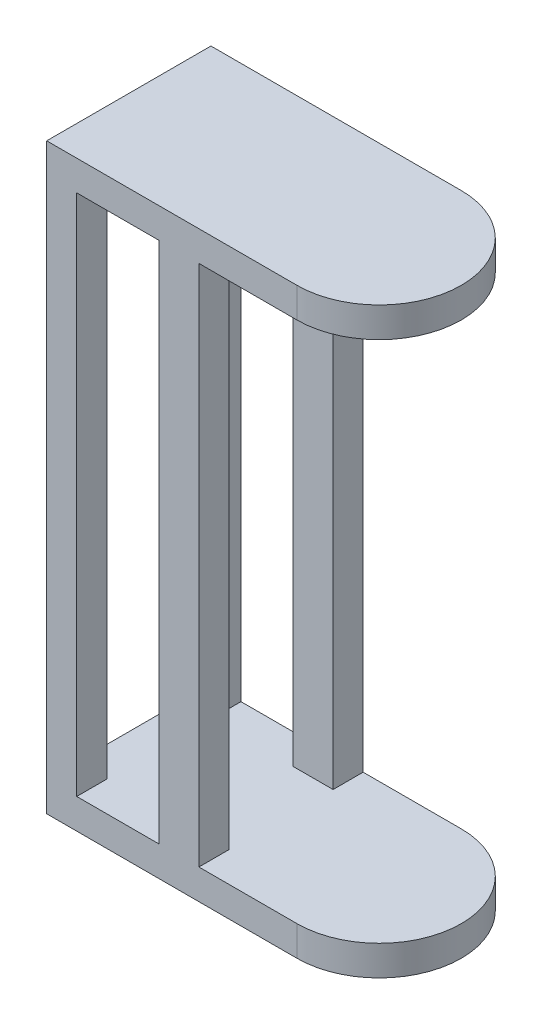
ISO-10303-21;
HEADER;
FILE_DESCRIPTION(('STEP AP214'),'2;1');
FILE_NAME('part.step','',(''),(''),'','','');
FILE_SCHEMA(('AUTOMOTIVE_DESIGN { 1 0 10303 214 1 1 1 1 }'));
ENDSEC;
DATA;
#1=APPLICATION_CONTEXT('core data for automotive mechanical design processes');
#2=APPLICATION_PROTOCOL_DEFINITION('international standard','automotive_design',2000,#1);
#3=PRODUCT_CONTEXT('',#1,'mechanical');
#4=PRODUCT('Part','Part','',(#3));
#5=PRODUCT_RELATED_PRODUCT_CATEGORY('part','',(#4));
#6=PRODUCT_DEFINITION_FORMATION('','',#4);
#7=PRODUCT_DEFINITION_CONTEXT('part definition',#1,'design');
#8=PRODUCT_DEFINITION('design','',#6,#7);
#9=PRODUCT_DEFINITION_SHAPE('','',#8);
#10=(LENGTH_UNIT() NAMED_UNIT(*) SI_UNIT(.MILLI.,.METRE.));
#11=(NAMED_UNIT(*) PLANE_ANGLE_UNIT() SI_UNIT($,.RADIAN.));
#12=(NAMED_UNIT(*) SI_UNIT($,.STERADIAN.) SOLID_ANGLE_UNIT());
#13=UNCERTAINTY_MEASURE_WITH_UNIT(LENGTH_MEASURE(1.E-05),#10,'distance_accuracy_value','');
#14=(GEOMETRIC_REPRESENTATION_CONTEXT(3) GLOBAL_UNCERTAINTY_ASSIGNED_CONTEXT((#13)) GLOBAL_UNIT_ASSIGNED_CONTEXT((#10,
#11,#12)) REPRESENTATION_CONTEXT('',''));
#15=CARTESIAN_POINT('',(0.,0.,0.));
#16=DIRECTION('',(0.,0.,1.));
#17=DIRECTION('',(1.,0.,0.));
#18=AXIS2_PLACEMENT_3D('',#15,#16,#17);
#19=CARTESIAN_POINT('',(126.,130.5,-26.));
#20=DIRECTION('',(0.,0.,-1.));
#21=DIRECTION('',(-1.,0.,0.));
#22=AXIS2_PLACEMENT_3D('',#19,#20,#21);
#23=PLANE('',#22);
#24=DIRECTION('',(-1.,0.,0.));
#25=VECTOR('',#24,1.);
#26=CARTESIAN_POINT('',(126.,-130.5,-26.));
#27=LINE('',#26,#25);
#28=CARTESIAN_POINT('',(-25.,-130.5,-26.));
#29=VERTEX_POINT('',#28);
#30=CARTESIAN_POINT('',(-40.,-130.5,-26.));
#31=VERTEX_POINT('',#30);
#32=EDGE_CURVE('E230',#29,#31,#27,.T.);
#33=ORIENTED_EDGE('',*,*,#32,.F.);
#34=DIRECTION('',(0.,1.,0.));
#35=VECTOR('',#34,1.);
#36=CARTESIAN_POINT('',(-25.,130.5,-26.));
#37=LINE('',#36,#35);
#38=CARTESIAN_POINT('',(-25.,130.5,-26.));
#39=VERTEX_POINT('',#38);
#40=EDGE_CURVE('E215',#29,#39,#37,.T.);
#41=ORIENTED_EDGE('',*,*,#40,.T.);
#42=DIRECTION('',(-1.,0.,0.));
#43=VECTOR('',#42,1.);
#44=CARTESIAN_POINT('',(126.,130.5,-26.));
#45=LINE('',#44,#43);
#46=CARTESIAN_POINT('',(-40.,130.5,-26.));
#47=VERTEX_POINT('',#46);
#48=EDGE_CURVE('E235',#39,#47,#45,.T.);
#49=ORIENTED_EDGE('',*,*,#48,.T.);
#50=DIRECTION('',(0.,-1.,0.));
#51=VECTOR('',#50,1.);
#52=CARTESIAN_POINT('',(-40.,130.5,-26.));
#53=LINE('',#52,#51);
#54=EDGE_CURVE('E218',#47,#31,#53,.T.);
#55=ORIENTED_EDGE('',*,*,#54,.T.);
#56=EDGE_LOOP('',(#33,#41,#49,#55));
#57=FACE_BOUND('',#56,.T.);
#58=ADVANCED_FACE('F29',(#57),#23,.F.);
#59=CARTESIAN_POINT('',(126.,-130.5,26.));
#60=DIRECTION('',(0.,0.,1.));
#61=DIRECTION('',(1.,0.,0.));
#62=AXIS2_PLACEMENT_3D('',#59,#60,#61);
#63=PLANE('',#62);
#64=DIRECTION('',(-1.,0.,0.));
#65=VECTOR('',#64,1.);
#66=CARTESIAN_POINT('',(126.,130.5,26.));
#67=LINE('',#66,#65);
#68=CARTESIAN_POINT('',(-25.,130.5,26.));
#69=VERTEX_POINT('',#68);
#70=CARTESIAN_POINT('',(-40.,130.5,26.));
#71=VERTEX_POINT('',#70);
#72=EDGE_CURVE('E239',#69,#71,#67,.T.);
#73=ORIENTED_EDGE('',*,*,#72,.F.);
#74=DIRECTION('',(0.,-1.,0.));
#75=VECTOR('',#74,1.);
#76=CARTESIAN_POINT('',(-25.,-130.5,26.));
#77=LINE('',#76,#75);
#78=CARTESIAN_POINT('',(-25.,-130.5,26.));
#79=VERTEX_POINT('',#78);
#80=EDGE_CURVE('E11',#69,#79,#77,.T.);
#81=ORIENTED_EDGE('',*,*,#80,.T.);
#82=DIRECTION('',(-1.,0.,0.));
#83=VECTOR('',#82,1.);
#84=CARTESIAN_POINT('',(126.,-130.5,26.));
#85=LINE('',#84,#83);
#86=CARTESIAN_POINT('',(-40.,-130.5,26.));
#87=VERTEX_POINT('',#86);
#88=EDGE_CURVE('E242',#79,#87,#85,.T.);
#89=ORIENTED_EDGE('',*,*,#88,.T.);
#90=DIRECTION('',(0.,1.,0.));
#91=VECTOR('',#90,1.);
#92=CARTESIAN_POINT('',(-40.,-130.5,26.));
#93=LINE('',#92,#91);
#94=EDGE_CURVE('E224',#87,#71,#93,.T.);
#95=ORIENTED_EDGE('',*,*,#94,.T.);
#96=EDGE_LOOP('',(#73,#81,#89,#95));
#97=FACE_BOUND('',#96,.T.);
#98=ADVANCED_FACE('F361',(#97),#63,.F.);
#99=CARTESIAN_POINT('',(36.0000000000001,130.5,-41.));
#100=DIRECTION('',(-1.,0.,0.));
#101=DIRECTION('',(0.,0.,1.));
#102=AXIS2_PLACEMENT_3D('',#99,#100,#101);
#103=PLANE('',#102);
#104=DIRECTION('',(0.,0.,1.));
#105=VECTOR('',#104,1.);
#106=CARTESIAN_POINT('',(36.0000000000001,130.5,-41.));
#107=LINE('',#106,#105);
#108=CARTESIAN_POINT('',(36.0000000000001,130.5,-41.));
#109=VERTEX_POINT('',#108);
#110=CARTESIAN_POINT('',(36.0000000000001,130.5,-26.));
#111=VERTEX_POINT('',#110);
#112=EDGE_CURVE('E265',#109,#111,#107,.T.);
#113=ORIENTED_EDGE('',*,*,#112,.T.);
#114=DIRECTION('',(0.,-1.,0.));
#115=VECTOR('',#114,1.);
#116=CARTESIAN_POINT('',(36.0000000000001,130.5,-26.));
#117=LINE('',#116,#115);
#118=CARTESIAN_POINT('',(36.0000000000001,-130.5,-26.));
#119=VERTEX_POINT('',#118);
#120=EDGE_CURVE('E311',#111,#119,#117,.T.);
#121=ORIENTED_EDGE('',*,*,#120,.T.);
#122=DIRECTION('',(0.,0.,1.));
#123=VECTOR('',#122,1.);
#124=CARTESIAN_POINT('',(36.0000000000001,-130.5,-41.));
#125=LINE('',#124,#123);
#126=CARTESIAN_POINT('',(36.0000000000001,-130.5,-41.));
#127=VERTEX_POINT('',#126);
#128=EDGE_CURVE('E260',#127,#119,#125,.T.);
#129=ORIENTED_EDGE('',*,*,#128,.F.);
#130=DIRECTION('',(0.,-1.,0.));
#131=VECTOR('',#130,1.);
#132=CARTESIAN_POINT('',(36.0000000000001,130.5,-41.));
#133=LINE('',#132,#131);
#134=EDGE_CURVE('E253',#109,#127,#133,.T.);
#135=ORIENTED_EDGE('',*,*,#134,.F.);
#136=EDGE_LOOP('',(#113,#121,#129,#135));
#137=FACE_BOUND('',#136,.T.);
#138=ADVANCED_FACE('F336',(#137),#103,.F.);
#139=CARTESIAN_POINT('',(85.,145.5,0.));
#140=DIRECTION('',(0.,-1.,0.));
#141=DIRECTION('',(0.,0.,-1.));
#142=AXIS2_PLACEMENT_3D('',#139,#140,#141);
#143=CYLINDRICAL_SURFACE('',#142,41.);
#144=DIRECTION('',(0.,-1.,0.));
#145=VECTOR('',#144,1.);
#146=CARTESIAN_POINT('',(85.,145.5,-41.));
#147=LINE('',#146,#145);
#148=CARTESIAN_POINT('',(85.,-130.5,-41.));
#149=VERTEX_POINT('',#148);
#150=CARTESIAN_POINT('',(85.,-145.5,-41.));
#151=VERTEX_POINT('',#150);
#152=EDGE_CURVE('E294',#149,#151,#147,.T.);
#153=ORIENTED_EDGE('',*,*,#152,.F.);
#154=CARTESIAN_POINT('',(85.,-130.5,0.));
#155=DIRECTION('',(0.,-1.,0.));
#156=DIRECTION('',(0.,0.,-1.));
#157=AXIS2_PLACEMENT_3D('',#154,#155,#156);
#158=CIRCLE('',#157,41.);
#159=CARTESIAN_POINT('',(85.,-130.5,41.));
#160=VERTEX_POINT('',#159);
#161=EDGE_CURVE('E269',#149,#160,#158,.T.);
#162=ORIENTED_EDGE('',*,*,#161,.T.);
#163=DIRECTION('',(0.,-1.,0.));
#164=VECTOR('',#163,1.);
#165=CARTESIAN_POINT('',(85.,145.5,41.));
#166=LINE('',#165,#164);
#167=CARTESIAN_POINT('',(85.,-145.5,41.));
#168=VERTEX_POINT('',#167);
#169=EDGE_CURVE('E298',#160,#168,#166,.T.);
#170=ORIENTED_EDGE('',*,*,#169,.T.);
#171=CARTESIAN_POINT('',(85.,-145.5,0.));
#172=DIRECTION('',(0.,1.,0.));
#173=DIRECTION('',(0.,0.,1.));
#174=AXIS2_PLACEMENT_3D('',#171,#172,#173);
#175=CIRCLE('',#174,41.);
#176=EDGE_CURVE('E277',#168,#151,#175,.T.);
#177=ORIENTED_EDGE('',*,*,#176,.T.);
#178=EDGE_LOOP('',(#153,#162,#170,#177));
#179=FACE_BOUND('',#178,.T.);
#180=ADVANCED_FACE('F330',(#179),#143,.T.);
#181=CARTESIAN_POINT('',(-40.,145.5,-41.));
#182=DIRECTION('',(1.,0.,0.));
#183=DIRECTION('',(0.,0.,-1.));
#184=AXIS2_PLACEMENT_3D('',#181,#182,#183);
#185=PLANE('',#184);
#186=DIRECTION('',(0.,0.,1.));
#187=VECTOR('',#186,1.);
#188=CARTESIAN_POINT('',(-40.,-130.5,-26.));
#189=LINE('',#188,#187);
#190=EDGE_CURVE('E221',#31,#87,#189,.T.);
#191=ORIENTED_EDGE('',*,*,#190,.F.);
#192=ORIENTED_EDGE('',*,*,#54,.F.);
#193=DIRECTION('',(0.,0.,-1.));
#194=VECTOR('',#193,1.);
#195=CARTESIAN_POINT('',(-40.,130.5,26.));
#196=LINE('',#195,#194);
#197=EDGE_CURVE('E227',#71,#47,#196,.T.);
#198=ORIENTED_EDGE('',*,*,#197,.F.);
#199=ORIENTED_EDGE('',*,*,#94,.F.);
#200=EDGE_LOOP('',(#191,#192,#198,#199));
#201=FACE_BOUND('',#200,.T.);
#202=DIRECTION('',(0.,0.,1.));
#203=VECTOR('',#202,1.);
#204=CARTESIAN_POINT('',(-40.,-145.5,-41.));
#205=LINE('',#204,#203);
#206=CARTESIAN_POINT('',(-40.,-145.5,-41.));
#207=VERTEX_POINT('',#206);
#208=CARTESIAN_POINT('',(-40.,-145.5,41.));
#209=VERTEX_POINT('',#208);
#210=EDGE_CURVE('E271',#207,#209,#205,.T.);
#211=ORIENTED_EDGE('',*,*,#210,.T.);
#212=DIRECTION('',(0.,-1.,0.));
#213=VECTOR('',#212,1.);
#214=CARTESIAN_POINT('',(-40.,145.5,41.));
#215=LINE('',#214,#213);
#216=CARTESIAN_POINT('',(-40.,145.5,41.));
#217=VERTEX_POINT('',#216);
#218=EDGE_CURVE('E302',#217,#209,#215,.T.);
#219=ORIENTED_EDGE('',*,*,#218,.F.);
#220=DIRECTION('',(0.,0.,1.));
#221=VECTOR('',#220,1.);
#222=CARTESIAN_POINT('',(-40.,145.5,-41.));
#223=LINE('',#222,#221);
#224=CARTESIAN_POINT('',(-40.,145.5,-41.));
#225=VERTEX_POINT('',#224);
#226=EDGE_CURVE('E282',#225,#217,#223,.T.);
#227=ORIENTED_EDGE('',*,*,#226,.F.);
#228=DIRECTION('',(0.,-1.,0.));
#229=VECTOR('',#228,1.);
#230=CARTESIAN_POINT('',(-40.,145.5,-41.));
#231=LINE('',#230,#229);
#232=EDGE_CURVE('E291',#225,#207,#231,.T.);
#233=ORIENTED_EDGE('',*,*,#232,.T.);
#234=EDGE_LOOP('',(#211,#219,#227,#233));
#235=FACE_BOUND('',#234,.T.);
#236=ADVANCED_FACE('F31',(#201,#235),#185,.F.);
#237=CARTESIAN_POINT('',(-40.,145.5,41.));
#238=DIRECTION('',(0.,0.,-1.));
#239=DIRECTION('',(-1.,0.,0.));
#240=AXIS2_PLACEMENT_3D('',#237,#238,#239);
#241=PLANE('',#240);
#242=DIRECTION('',(1.,0.,0.));
#243=VECTOR('',#242,1.);
#244=CARTESIAN_POINT('',(-25.,-130.5,41.));
#245=LINE('',#244,#243);
#246=CARTESIAN_POINT('',(-25.,-130.5,41.));
#247=VERTEX_POINT('',#246);
#248=CARTESIAN_POINT('',(16.0000000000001,-130.5,41.));
#249=VERTEX_POINT('',#248);
#250=EDGE_CURVE('E179',#247,#249,#245,.T.);
#251=ORIENTED_EDGE('',*,*,#250,.F.);
#252=DIRECTION('',(0.,-1.,0.));
#253=VECTOR('',#252,1.);
#254=CARTESIAN_POINT('',(-25.,130.5,41.));
#255=LINE('',#254,#253);
#256=CARTESIAN_POINT('',(-25.,130.5,41.));
#257=VERTEX_POINT('',#256);
#258=EDGE_CURVE('E44',#257,#247,#255,.T.);
#259=ORIENTED_EDGE('',*,*,#258,.F.);
#260=DIRECTION('',(-1.,0.,0.));
#261=VECTOR('',#260,1.);
#262=CARTESIAN_POINT('',(-25.,130.5,41.));
#263=LINE('',#262,#261);
#264=CARTESIAN_POINT('',(16.0000000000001,130.5,41.));
#265=VERTEX_POINT('',#264);
#266=EDGE_CURVE('E189',#265,#257,#263,.T.);
#267=ORIENTED_EDGE('',*,*,#266,.F.);
#268=DIRECTION('',(0.,1.,0.));
#269=VECTOR('',#268,1.);
#270=CARTESIAN_POINT('',(16.0000000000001,130.5,41.));
#271=LINE('',#270,#269);
#272=EDGE_CURVE('E170',#249,#265,#271,.T.);
#273=ORIENTED_EDGE('',*,*,#272,.F.);
#274=EDGE_LOOP('',(#251,#259,#267,#273));
#275=FACE_BOUND('',#274,.T.);
#276=ORIENTED_EDGE('',*,*,#169,.F.);
#277=DIRECTION('',(1.,0.,0.));
#278=VECTOR('',#277,1.);
#279=CARTESIAN_POINT('',(126.,-130.5,41.));
#280=LINE('',#279,#278);
#281=CARTESIAN_POINT('',(36.0000000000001,-130.5,41.));
#282=VERTEX_POINT('',#281);
#283=EDGE_CURVE('E250',#282,#160,#280,.T.);
#284=ORIENTED_EDGE('',*,*,#283,.F.);
#285=DIRECTION('',(0.,-1.,0.));
#286=VECTOR('',#285,1.);
#287=CARTESIAN_POINT('',(36.0000000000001,130.5,41.));
#288=LINE('',#287,#286);
#289=CARTESIAN_POINT('',(36.0000000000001,130.5,41.));
#290=VERTEX_POINT('',#289);
#291=EDGE_CURVE('E247',#290,#282,#288,.T.);
#292=ORIENTED_EDGE('',*,*,#291,.F.);
#293=DIRECTION('',(-1.,0.,0.));
#294=VECTOR('',#293,1.);
#295=CARTESIAN_POINT('',(126.,130.5,41.));
#296=LINE('',#295,#294);
#297=CARTESIAN_POINT('',(85.,130.5,41.));
#298=VERTEX_POINT('',#297);
#299=EDGE_CURVE('E234',#298,#290,#296,.T.);
#300=ORIENTED_EDGE('',*,*,#299,.F.);
#301=CARTESIAN_POINT('',(85.,145.5,41.));
#302=VERTEX_POINT('',#301);
#303=EDGE_CURVE('E299',#302,#298,#166,.T.);
#304=ORIENTED_EDGE('',*,*,#303,.F.);
#305=DIRECTION('',(1.,0.,0.));
#306=VECTOR('',#305,1.);
#307=CARTESIAN_POINT('',(-40.,145.5,41.));
#308=LINE('',#307,#306);
#309=EDGE_CURVE('E285',#217,#302,#308,.T.);
#310=ORIENTED_EDGE('',*,*,#309,.F.);
#311=ORIENTED_EDGE('',*,*,#218,.T.);
#312=DIRECTION('',(1.,0.,0.));
#313=VECTOR('',#312,1.);
#314=CARTESIAN_POINT('',(-40.,-145.5,41.));
#315=LINE('',#314,#313);
#316=EDGE_CURVE('E274',#209,#168,#315,.T.);
#317=ORIENTED_EDGE('',*,*,#316,.T.);
#318=EDGE_LOOP('',(#276,#284,#292,#300,#304,#310,#311,#317));
#319=FACE_BOUND('',#318,.T.);
#320=ADVANCED_FACE('F186',(#275,#319),#241,.F.);
#321=ORIENTED_EDGE('',*,*,#303,.T.);
#322=CARTESIAN_POINT('',(85.,130.5,0.));
#323=DIRECTION('',(0.,1.,0.));
#324=DIRECTION('',(0.,0.,1.));
#325=AXIS2_PLACEMENT_3D('',#322,#323,#324);
#326=CIRCLE('',#325,41.);
#327=CARTESIAN_POINT('',(85.,130.5,-41.));
#328=VERTEX_POINT('',#327);
#329=EDGE_CURVE('E263',#298,#328,#326,.T.);
#330=ORIENTED_EDGE('',*,*,#329,.T.);
#331=CARTESIAN_POINT('',(85.,145.5,-41.));
#332=VERTEX_POINT('',#331);
#333=EDGE_CURVE('E295',#332,#328,#147,.T.);
#334=ORIENTED_EDGE('',*,*,#333,.F.);
#335=CARTESIAN_POINT('',(85.,145.5,0.));
#336=DIRECTION('',(0.,1.,0.));
#337=DIRECTION('',(0.,0.,1.));
#338=AXIS2_PLACEMENT_3D('',#335,#336,#337);
#339=CIRCLE('',#338,41.);
#340=EDGE_CURVE('E287',#302,#332,#339,.T.);
#341=ORIENTED_EDGE('',*,*,#340,.F.);
#342=EDGE_LOOP('',(#321,#330,#334,#341));
#343=FACE_BOUND('',#342,.T.);
#344=ADVANCED_FACE('F395',(#343),#143,.T.);
#345=CARTESIAN_POINT('',(-40.,145.5,-41.));
#346=DIRECTION('',(0.,0.,1.));
#347=DIRECTION('',(1.,0.,0.));
#348=AXIS2_PLACEMENT_3D('',#345,#346,#347);
#349=PLANE('',#348);
#350=DIRECTION('',(-1.,0.,0.));
#351=VECTOR('',#350,1.);
#352=CARTESIAN_POINT('',(-25.,130.5,-41.));
#353=LINE('',#352,#351);
#354=CARTESIAN_POINT('',(16.0000000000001,130.5,-41.));
#355=VERTEX_POINT('',#354);
#356=CARTESIAN_POINT('',(-25.,130.5,-41.));
#357=VERTEX_POINT('',#356);
#358=EDGE_CURVE('E201',#355,#357,#353,.T.);
#359=ORIENTED_EDGE('',*,*,#358,.T.);
#360=DIRECTION('',(0.,-1.,0.));
#361=VECTOR('',#360,1.);
#362=CARTESIAN_POINT('',(-25.,130.5,-41.));
#363=LINE('',#362,#361);
#364=CARTESIAN_POINT('',(-25.,-130.5,-41.));
#365=VERTEX_POINT('',#364);
#366=EDGE_CURVE('E191',#357,#365,#363,.T.);
#367=ORIENTED_EDGE('',*,*,#366,.T.);
#368=DIRECTION('',(1.,0.,0.));
#369=VECTOR('',#368,1.);
#370=CARTESIAN_POINT('',(-25.,-130.5,-41.));
#371=LINE('',#370,#369);
#372=CARTESIAN_POINT('',(16.0000000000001,-130.5,-41.));
#373=VERTEX_POINT('',#372);
#374=EDGE_CURVE('E197',#365,#373,#371,.T.);
#375=ORIENTED_EDGE('',*,*,#374,.T.);
#376=DIRECTION('',(0.,1.,0.));
#377=VECTOR('',#376,1.);
#378=CARTESIAN_POINT('',(16.0000000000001,130.5,-41.));
#379=LINE('',#378,#377);
#380=EDGE_CURVE('E52',#373,#355,#379,.T.);
#381=ORIENTED_EDGE('',*,*,#380,.T.);
#382=EDGE_LOOP('',(#359,#367,#375,#381));
#383=FACE_BOUND('',#382,.T.);
#384=ORIENTED_EDGE('',*,*,#134,.T.);
#385=DIRECTION('',(1.,0.,0.));
#386=VECTOR('',#385,1.);
#387=CARTESIAN_POINT('',(126.,-130.5,-41.));
#388=LINE('',#387,#386);
#389=EDGE_CURVE('E256',#127,#149,#388,.T.);
#390=ORIENTED_EDGE('',*,*,#389,.T.);
#391=ORIENTED_EDGE('',*,*,#152,.T.);
#392=DIRECTION('',(-1.,0.,0.));
#393=VECTOR('',#392,1.);
#394=CARTESIAN_POINT('',(-40.,-145.5,-41.));
#395=LINE('',#394,#393);
#396=EDGE_CURVE('E280',#151,#207,#395,.T.);
#397=ORIENTED_EDGE('',*,*,#396,.T.);
#398=ORIENTED_EDGE('',*,*,#232,.F.);
#399=DIRECTION('',(-1.,0.,0.));
#400=VECTOR('',#399,1.);
#401=CARTESIAN_POINT('',(-40.,145.5,-41.));
#402=LINE('',#401,#400);
#403=EDGE_CURVE('E289',#332,#225,#402,.T.);
#404=ORIENTED_EDGE('',*,*,#403,.F.);
#405=ORIENTED_EDGE('',*,*,#333,.T.);
#406=DIRECTION('',(-1.,0.,0.));
#407=VECTOR('',#406,1.);
#408=CARTESIAN_POINT('',(-40.,130.5,-41.));
#409=LINE('',#408,#407);
#410=EDGE_CURVE('E305',#328,#109,#409,.T.);
#411=ORIENTED_EDGE('',*,*,#410,.T.);
#412=EDGE_LOOP('',(#384,#390,#391,#397,#398,#404,#405,#411));
#413=FACE_BOUND('',#412,.T.);
#414=ADVANCED_FACE('F333',(#383,#413),#349,.F.);
#415=CARTESIAN_POINT('',(85.,145.5,0.));
#416=DIRECTION('',(0.,1.,0.));
#417=DIRECTION('',(0.,0.,1.));
#418=AXIS2_PLACEMENT_3D('',#415,#416,#417);
#419=PLANE('',#418);
#420=ORIENTED_EDGE('',*,*,#226,.T.);
#421=ORIENTED_EDGE('',*,*,#309,.T.);
#422=ORIENTED_EDGE('',*,*,#340,.T.);
#423=ORIENTED_EDGE('',*,*,#403,.T.);
#424=EDGE_LOOP('',(#420,#421,#422,#423));
#425=FACE_BOUND('',#424,.T.);
#426=ADVANCED_FACE('F404',(#425),#419,.T.);
#427=CARTESIAN_POINT('',(85.,-145.5,0.));
#428=DIRECTION('',(0.,1.,0.));
#429=DIRECTION('',(0.,0.,1.));
#430=AXIS2_PLACEMENT_3D('',#427,#428,#429);
#431=PLANE('',#430);
#432=ORIENTED_EDGE('',*,*,#210,.F.);
#433=ORIENTED_EDGE('',*,*,#396,.F.);
#434=ORIENTED_EDGE('',*,*,#176,.F.);
#435=ORIENTED_EDGE('',*,*,#316,.F.);
#436=EDGE_LOOP('',(#432,#433,#434,#435));
#437=FACE_BOUND('',#436,.T.);
#438=ADVANCED_FACE('F415',(#437),#431,.F.);
#439=CARTESIAN_POINT('',(126.,-130.5,-41.));
#440=DIRECTION('',(0.,-1.,0.));
#441=DIRECTION('',(0.,0.,-1.));
#442=AXIS2_PLACEMENT_3D('',#439,#440,#441);
#443=PLANE('',#442);
#444=CARTESIAN_POINT('',(16.0000000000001,-130.5,-26.));
#445=VERTEX_POINT('',#444);
#446=EDGE_CURVE('E243',#119,#445,#27,.T.);
#447=ORIENTED_EDGE('',*,*,#446,.T.);
#448=DIRECTION('',(0.,0.,1.));
#449=VECTOR('',#448,1.);
#450=CARTESIAN_POINT('',(16.0000000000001,-130.5,-41.));
#451=LINE('',#450,#449);
#452=EDGE_CURVE('E175',#373,#445,#451,.T.);
#453=ORIENTED_EDGE('',*,*,#452,.F.);
#454=ORIENTED_EDGE('',*,*,#374,.F.);
#455=DIRECTION('',(0.,0.,1.));
#456=VECTOR('',#455,1.);
#457=CARTESIAN_POINT('',(-25.,-130.5,-41.));
#458=LINE('',#457,#456);
#459=EDGE_CURVE('E176',#365,#29,#458,.T.);
#460=ORIENTED_EDGE('',*,*,#459,.T.);
#461=ORIENTED_EDGE('',*,*,#32,.T.);
#462=ORIENTED_EDGE('',*,*,#190,.T.);
#463=ORIENTED_EDGE('',*,*,#88,.F.);
#464=EDGE_CURVE('E183',#79,#247,#458,.T.);
#465=ORIENTED_EDGE('',*,*,#464,.T.);
#466=ORIENTED_EDGE('',*,*,#250,.T.);
#467=CARTESIAN_POINT('',(16.0000000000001,-130.5,26.));
#468=VERTEX_POINT('',#467);
#469=EDGE_CURVE('E166',#468,#249,#451,.T.);
#470=ORIENTED_EDGE('',*,*,#469,.F.);
#471=CARTESIAN_POINT('',(36.0000000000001,-130.5,26.));
#472=VERTEX_POINT('',#471);
#473=EDGE_CURVE('E240',#472,#468,#85,.T.);
#474=ORIENTED_EDGE('',*,*,#473,.F.);
#475=EDGE_CURVE('E264',#472,#282,#125,.T.);
#476=ORIENTED_EDGE('',*,*,#475,.T.);
#477=ORIENTED_EDGE('',*,*,#283,.T.);
#478=ORIENTED_EDGE('',*,*,#161,.F.);
#479=ORIENTED_EDGE('',*,*,#389,.F.);
#480=ORIENTED_EDGE('',*,*,#128,.T.);
#481=EDGE_LOOP('',(#447,#453,#454,#460,#461,#462,#463,#465,#466,#470,#474,#476,#477,#478,#479,#480));
#482=FACE_BOUND('',#481,.T.);
#483=ADVANCED_FACE('F181',(#482),#443,.F.);
#484=CARTESIAN_POINT('',(126.,130.5,-41.));
#485=DIRECTION('',(0.,1.,0.));
#486=DIRECTION('',(0.,0.,1.));
#487=AXIS2_PLACEMENT_3D('',#484,#485,#486);
#488=PLANE('',#487);
#489=CARTESIAN_POINT('',(36.0000000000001,130.5,26.));
#490=VERTEX_POINT('',#489);
#491=CARTESIAN_POINT('',(16.0000000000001,130.5,26.));
#492=VERTEX_POINT('',#491);
#493=EDGE_CURVE('E236',#490,#492,#67,.T.);
#494=ORIENTED_EDGE('',*,*,#493,.T.);
#495=DIRECTION('',(0.,0.,1.));
#496=VECTOR('',#495,1.);
#497=CARTESIAN_POINT('',(16.0000000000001,130.5,-41.));
#498=LINE('',#497,#496);
#499=EDGE_CURVE('E210',#492,#265,#498,.T.);
#500=ORIENTED_EDGE('',*,*,#499,.T.);
#501=ORIENTED_EDGE('',*,*,#266,.T.);
#502=DIRECTION('',(0.,0.,1.));
#503=VECTOR('',#502,1.);
#504=CARTESIAN_POINT('',(-25.,130.5,-41.));
#505=LINE('',#504,#503);
#506=EDGE_CURVE('E207',#69,#257,#505,.T.);
#507=ORIENTED_EDGE('',*,*,#506,.F.);
#508=ORIENTED_EDGE('',*,*,#72,.T.);
#509=ORIENTED_EDGE('',*,*,#197,.T.);
#510=ORIENTED_EDGE('',*,*,#48,.F.);
#511=EDGE_CURVE('E204',#357,#39,#505,.T.);
#512=ORIENTED_EDGE('',*,*,#511,.F.);
#513=ORIENTED_EDGE('',*,*,#358,.F.);
#514=CARTESIAN_POINT('',(16.0000000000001,130.5,-26.));
#515=VERTEX_POINT('',#514);
#516=EDGE_CURVE('E208',#355,#515,#498,.T.);
#517=ORIENTED_EDGE('',*,*,#516,.T.);
#518=EDGE_CURVE('E231',#111,#515,#45,.T.);
#519=ORIENTED_EDGE('',*,*,#518,.F.);
#520=ORIENTED_EDGE('',*,*,#112,.F.);
#521=ORIENTED_EDGE('',*,*,#410,.F.);
#522=ORIENTED_EDGE('',*,*,#329,.F.);
#523=ORIENTED_EDGE('',*,*,#299,.T.);
#524=EDGE_CURVE('E259',#490,#290,#107,.T.);
#525=ORIENTED_EDGE('',*,*,#524,.F.);
#526=EDGE_LOOP('',(#494,#500,#501,#507,#508,#509,#510,#512,#513,#517,#519,#520,#521,#522,#523,#525));
#527=FACE_BOUND('',#526,.T.);
#528=ADVANCED_FACE('F318',(#527),#488,.F.);
#529=ORIENTED_EDGE('',*,*,#475,.F.);
#530=DIRECTION('',(0.,1.,0.));
#531=VECTOR('',#530,1.);
#532=CARTESIAN_POINT('',(36.0000000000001,130.5,26.));
#533=LINE('',#532,#531);
#534=EDGE_CURVE('E308',#472,#490,#533,.T.);
#535=ORIENTED_EDGE('',*,*,#534,.T.);
#536=ORIENTED_EDGE('',*,*,#524,.T.);
#537=ORIENTED_EDGE('',*,*,#291,.T.);
#538=EDGE_LOOP('',(#529,#535,#536,#537));
#539=FACE_BOUND('',#538,.T.);
#540=ADVANCED_FACE('F323',(#539),#103,.F.);
#541=ORIENTED_EDGE('',*,*,#518,.T.);
#542=DIRECTION('',(0.,-1.,0.));
#543=VECTOR('',#542,1.);
#544=CARTESIAN_POINT('',(16.0000000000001,130.5,-26.));
#545=LINE('',#544,#543);
#546=EDGE_CURVE('E206',#515,#445,#545,.T.);
#547=ORIENTED_EDGE('',*,*,#546,.T.);
#548=ORIENTED_EDGE('',*,*,#446,.F.);
#549=ORIENTED_EDGE('',*,*,#120,.F.);
#550=EDGE_LOOP('',(#541,#547,#548,#549));
#551=FACE_BOUND('',#550,.T.);
#552=ADVANCED_FACE('F340',(#551),#23,.F.);
#553=ORIENTED_EDGE('',*,*,#473,.T.);
#554=DIRECTION('',(0.,1.,0.));
#555=VECTOR('',#554,1.);
#556=CARTESIAN_POINT('',(16.0000000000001,-130.5,26.));
#557=LINE('',#556,#555);
#558=EDGE_CURVE('E37',#468,#492,#557,.T.);
#559=ORIENTED_EDGE('',*,*,#558,.T.);
#560=ORIENTED_EDGE('',*,*,#493,.F.);
#561=ORIENTED_EDGE('',*,*,#534,.F.);
#562=EDGE_LOOP('',(#553,#559,#560,#561));
#563=FACE_BOUND('',#562,.T.);
#564=ADVANCED_FACE('F314',(#563),#63,.F.);
#565=CARTESIAN_POINT('',(16.0000000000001,130.5,-41.));
#566=DIRECTION('',(1.,0.,0.));
#567=DIRECTION('',(0.,0.,-1.));
#568=AXIS2_PLACEMENT_3D('',#565,#566,#567);
#569=PLANE('',#568);
#570=ORIENTED_EDGE('',*,*,#469,.T.);
#571=ORIENTED_EDGE('',*,*,#272,.T.);
#572=ORIENTED_EDGE('',*,*,#499,.F.);
#573=ORIENTED_EDGE('',*,*,#558,.F.);
#574=EDGE_LOOP('',(#570,#571,#572,#573));
#575=FACE_BOUND('',#574,.T.);
#576=ADVANCED_FACE('F168',(#575),#569,.F.);
#577=CARTESIAN_POINT('',(-25.,130.5,-41.));
#578=DIRECTION('',(-1.,0.,0.));
#579=DIRECTION('',(0.,0.,1.));
#580=AXIS2_PLACEMENT_3D('',#577,#578,#579);
#581=PLANE('',#580);
#582=ORIENTED_EDGE('',*,*,#506,.T.);
#583=ORIENTED_EDGE('',*,*,#258,.T.);
#584=ORIENTED_EDGE('',*,*,#464,.F.);
#585=ORIENTED_EDGE('',*,*,#80,.F.);
#586=EDGE_LOOP('',(#582,#583,#584,#585));
#587=FACE_BOUND('',#586,.T.);
#588=ADVANCED_FACE('F363',(#587),#581,.F.);
#589=ORIENTED_EDGE('',*,*,#459,.F.);
#590=ORIENTED_EDGE('',*,*,#366,.F.);
#591=ORIENTED_EDGE('',*,*,#511,.T.);
#592=ORIENTED_EDGE('',*,*,#40,.F.);
#593=EDGE_LOOP('',(#589,#590,#591,#592));
#594=FACE_BOUND('',#593,.T.);
#595=ADVANCED_FACE('F348',(#594),#581,.F.);
#596=ORIENTED_EDGE('',*,*,#516,.F.);
#597=ORIENTED_EDGE('',*,*,#380,.F.);
#598=ORIENTED_EDGE('',*,*,#452,.T.);
#599=ORIENTED_EDGE('',*,*,#546,.F.);
#600=EDGE_LOOP('',(#596,#597,#598,#599));
#601=FACE_BOUND('',#600,.T.);
#602=ADVANCED_FACE('F343',(#601),#569,.F.);
#603=CLOSED_SHELL('',(#58,#98,#138,#180,#236,#320,#344,#414,#426,#438,#483,#528,#540,#552,#564,
#576,#588,#595,#602));
#604=MANIFOLD_SOLID_BREP('B2',#603);
#605=ADVANCED_BREP_SHAPE_REPRESENTATION('',(#18,#604),#14);
#606=SHAPE_DEFINITION_REPRESENTATION(#9,#605);
ENDSEC;
END-ISO-10303-21;
